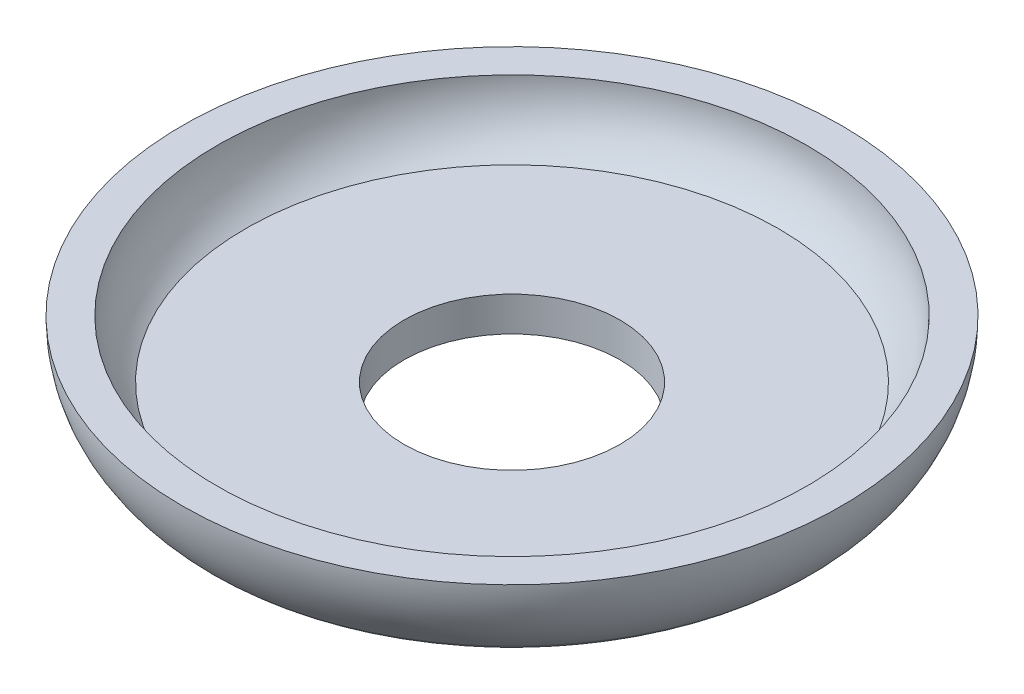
from build123d import *


with BuildPart() as part:
    # Sketch2 → Revolve1 (revolve)
    with BuildSketch(Plane.XY, mode=Mode.PRIVATE) as revolve1_sk:
        with BuildLine():
            Line((4.7625, 0), (11.371782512, 0))
            ThreePointArc((11.371782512, 0), (12.345828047, 0.194187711), (13.170938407, 0.747058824))
            ThreePointArc((13.170938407, 0.747058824), (14.185363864, 2.26952669), (14.5415, 4.064))
            Line((14.5415, 4.064), (13.0175, 4.064))
            ThreePointArc((13.0175, 4.064), (12.682306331, 2.644096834), (11.7475, 1.524))
            Line((11.7475, 1.524), (4.7625, 1.524))
            Line((4.7625, 1.524), (4.7625, 0))
        make_face()
    revolve(revolve1_sk.sketch.rotate(Axis((0, 0, 0), (0, 1, 0)), 90), axis=Axis((0, 0, 0), (0, 1, 0)))


solid = part.part
